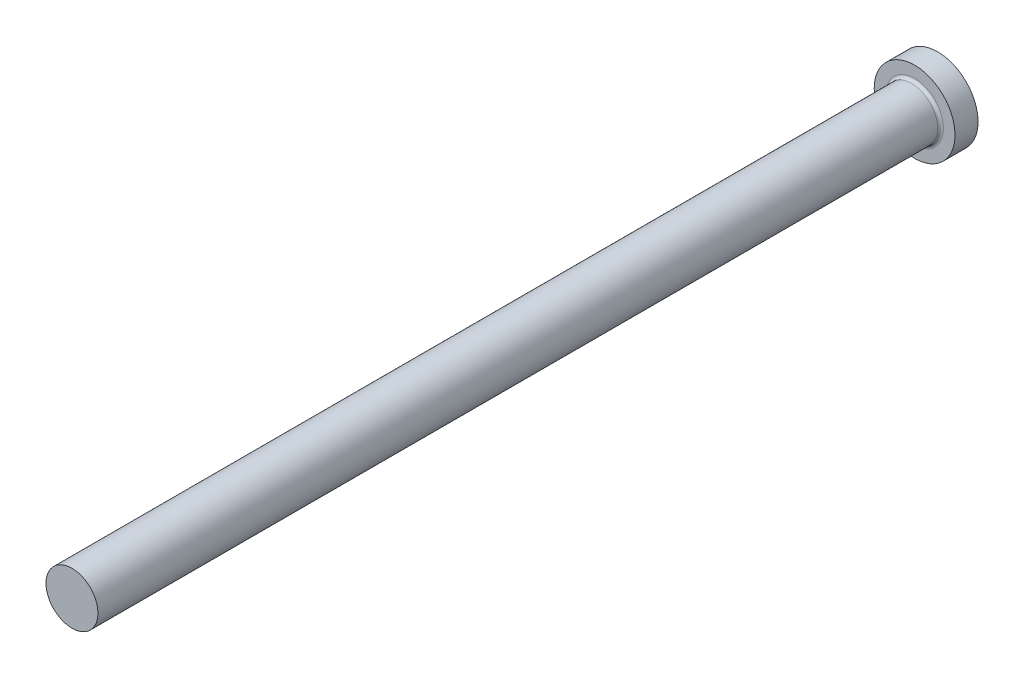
ISO-10303-21;
HEADER;
FILE_DESCRIPTION(('STEP AP214'),'2;1');
FILE_NAME('part.step','',(''),(''),'','','');
FILE_SCHEMA(('AUTOMOTIVE_DESIGN { 1 0 10303 214 1 1 1 1 }'));
ENDSEC;
DATA;
#1=APPLICATION_CONTEXT('core data for automotive mechanical design processes');
#2=APPLICATION_PROTOCOL_DEFINITION('international standard','automotive_design',2000,#1);
#3=PRODUCT_CONTEXT('',#1,'mechanical');
#4=PRODUCT('Part','Part','',(#3));
#5=PRODUCT_RELATED_PRODUCT_CATEGORY('part','',(#4));
#6=PRODUCT_DEFINITION_FORMATION('','',#4);
#7=PRODUCT_DEFINITION_CONTEXT('part definition',#1,'design');
#8=PRODUCT_DEFINITION('design','',#6,#7);
#9=PRODUCT_DEFINITION_SHAPE('','',#8);
#10=(LENGTH_UNIT() NAMED_UNIT(*) SI_UNIT(.MILLI.,.METRE.));
#11=(NAMED_UNIT(*) PLANE_ANGLE_UNIT() SI_UNIT($,.RADIAN.));
#12=(NAMED_UNIT(*) SI_UNIT($,.STERADIAN.) SOLID_ANGLE_UNIT());
#13=UNCERTAINTY_MEASURE_WITH_UNIT(LENGTH_MEASURE(1.E-05),#10,'distance_accuracy_value','');
#14=(GEOMETRIC_REPRESENTATION_CONTEXT(3) GLOBAL_UNCERTAINTY_ASSIGNED_CONTEXT((#13)) GLOBAL_UNIT_ASSIGNED_CONTEXT((#10,
#11,#12)) REPRESENTATION_CONTEXT('',''));
#15=CARTESIAN_POINT('',(0.,0.,0.));
#16=DIRECTION('',(0.,0.,1.));
#17=DIRECTION('',(1.,0.,0.));
#18=AXIS2_PLACEMENT_3D('',#15,#16,#17);
#19=CARTESIAN_POINT('',(7.,0.,4.));
#20=DIRECTION('',(0.,0.,-1.));
#21=DIRECTION('',(-1.,0.,0.));
#22=AXIS2_PLACEMENT_3D('',#19,#20,#21);
#23=PLANE('',#22);
#24=CARTESIAN_POINT('',(0.,0.,4.));
#25=DIRECTION('',(0.,0.,-1.));
#26=DIRECTION('',(-1.,0.,0.));
#27=AXIS2_PLACEMENT_3D('',#24,#25,#26);
#28=CIRCLE('',#27,5.00000000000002);
#29=CARTESIAN_POINT('',(-5.00000000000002,0.,4.));
#30=VERTEX_POINT('',#29);
#31=EDGE_CURVE('E40',#30,#30,#28,.T.);
#32=ORIENTED_EDGE('',*,*,#31,.T.);
#33=EDGE_LOOP('',(#32));
#34=FACE_BOUND('',#33,.T.);
#35=CARTESIAN_POINT('',(0.,0.,4.));
#36=DIRECTION('',(0.,0.,-1.));
#37=DIRECTION('',(-1.,0.,0.));
#38=AXIS2_PLACEMENT_3D('',#35,#36,#37);
#39=CIRCLE('',#38,7.);
#40=CARTESIAN_POINT('',(-7.,0.,4.));
#41=VERTEX_POINT('',#40);
#42=EDGE_CURVE('E44',#41,#41,#39,.T.);
#43=ORIENTED_EDGE('',*,*,#42,.F.);
#44=EDGE_LOOP('',(#43));
#45=FACE_BOUND('',#44,.T.);
#46=ADVANCED_FACE('F33',(#34,#45),#23,.F.);
#47=CARTESIAN_POINT('',(0.,0.,-9.03322817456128));
#48=DIRECTION('',(0.,0.,-1.));
#49=DIRECTION('',(-1.,0.,0.));
#50=AXIS2_PLACEMENT_3D('',#47,#48,#49);
#51=CYLINDRICAL_SURFACE('',#50,7.);
#52=CARTESIAN_POINT('',(0.,0.,0.));
#53=DIRECTION('',(0.,0.,-1.));
#54=DIRECTION('',(-1.,0.,0.));
#55=AXIS2_PLACEMENT_3D('',#52,#53,#54);
#56=CIRCLE('',#55,7.);
#57=CARTESIAN_POINT('',(-7.,0.,0.));
#58=VERTEX_POINT('',#57);
#59=EDGE_CURVE('E48',#58,#58,#56,.T.);
#60=ORIENTED_EDGE('',*,*,#59,.F.);
#61=EDGE_LOOP('',(#60));
#62=FACE_BOUND('',#61,.T.);
#63=ORIENTED_EDGE('',*,*,#42,.T.);
#64=EDGE_LOOP('',(#63));
#65=FACE_BOUND('',#64,.T.);
#66=ADVANCED_FACE('F68',(#62,#65),#51,.T.);
#67=CARTESIAN_POINT('',(0.,0.,0.));
#68=DIRECTION('',(0.,0.,1.));
#69=DIRECTION('',(1.,0.,0.));
#70=AXIS2_PLACEMENT_3D('',#67,#68,#69);
#71=PLANE('',#70);
#72=ORIENTED_EDGE('',*,*,#59,.T.);
#73=EDGE_LOOP('',(#72));
#74=FACE_BOUND('',#73,.T.);
#75=ADVANCED_FACE('F61',(#74),#71,.F.);
#76=CARTESIAN_POINT('',(0.,0.,150.));
#77=DIRECTION('',(0.,0.,-1.));
#78=DIRECTION('',(-1.,0.,0.));
#79=AXIS2_PLACEMENT_3D('',#76,#77,#78);
#80=PLANE('',#79);
#81=CARTESIAN_POINT('',(0.,0.,150.));
#82=DIRECTION('',(0.,0.,-1.));
#83=DIRECTION('',(-1.,0.,0.));
#84=AXIS2_PLACEMENT_3D('',#81,#82,#83);
#85=CIRCLE('',#84,4.50000000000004);
#86=CARTESIAN_POINT('',(-4.50000000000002,0.,150.));
#87=VERTEX_POINT('',#86);
#88=EDGE_CURVE('E53',#87,#87,#85,.T.);
#89=ORIENTED_EDGE('',*,*,#88,.F.);
#90=EDGE_LOOP('',(#89));
#91=FACE_BOUND('',#90,.T.);
#92=ADVANCED_FACE('F59',(#91),#80,.F.);
#93=CARTESIAN_POINT('',(0.,0.,-9.03322817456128));
#94=DIRECTION('',(0.,0.,-1.));
#95=DIRECTION('',(-1.,0.,0.));
#96=AXIS2_PLACEMENT_3D('',#93,#94,#95);
#97=CYLINDRICAL_SURFACE('',#96,4.50000000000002);
#98=CARTESIAN_POINT('',(0.,0.,4.5));
#99=DIRECTION('',(0.,0.,-1.));
#100=DIRECTION('',(-1.,0.,0.));
#101=AXIS2_PLACEMENT_3D('',#98,#99,#100);
#102=CIRCLE('',#101,4.50000000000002);
#103=CARTESIAN_POINT('',(-4.50000000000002,0.,4.5));
#104=VERTEX_POINT('',#103);
#105=EDGE_CURVE('E10',#104,#104,#102,.F.);
#106=ORIENTED_EDGE('',*,*,#105,.T.);
#107=EDGE_LOOP('',(#106));
#108=FACE_BOUND('',#107,.T.);
#109=ORIENTED_EDGE('',*,*,#88,.T.);
#110=EDGE_LOOP('',(#109));
#111=FACE_BOUND('',#110,.T.);
#112=ADVANCED_FACE('F57',(#108,#111),#97,.T.);
#113=CARTESIAN_POINT('',(0.,0.,4.5));
#114=DIRECTION('',(0.,0.,-1.));
#115=DIRECTION('',(-1.,0.,0.));
#116=AXIS2_PLACEMENT_3D('',#113,#114,#115);
#117=TOROIDAL_SURFACE('',#116,5.00000000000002,0.5);
#118=ORIENTED_EDGE('',*,*,#105,.F.);
#119=EDGE_LOOP('',(#118));
#120=FACE_BOUND('',#119,.T.);
#121=ORIENTED_EDGE('',*,*,#31,.F.);
#122=EDGE_LOOP('',(#121));
#123=FACE_BOUND('',#122,.T.);
#124=ADVANCED_FACE('F35',(#120,#123),#117,.F.);
#125=CLOSED_SHELL('',(#46,#66,#75,#92,#112,#124));
#126=MANIFOLD_SOLID_BREP('B2',#125);
#127=ADVANCED_BREP_SHAPE_REPRESENTATION('',(#18,#126),#14);
#128=SHAPE_DEFINITION_REPRESENTATION(#9,#127);
ENDSEC;
END-ISO-10303-21;
